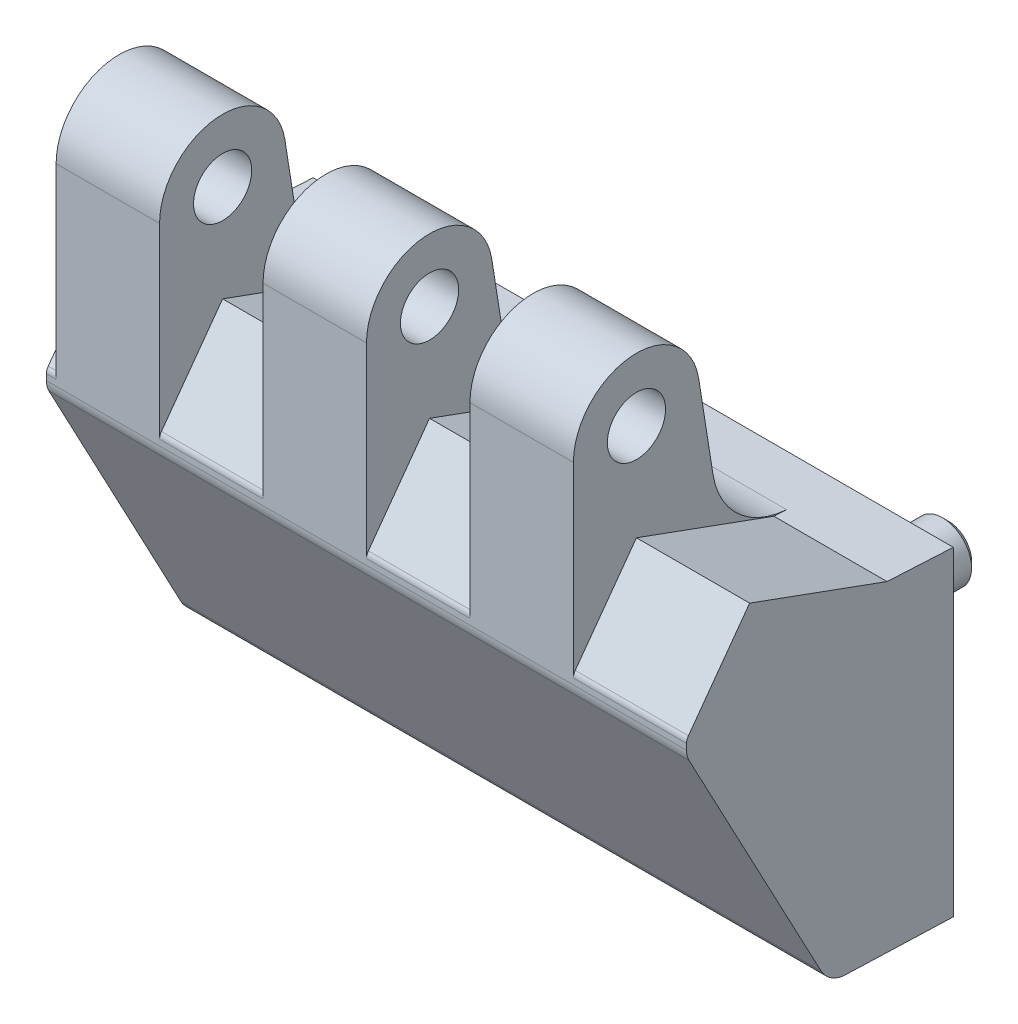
ISO-10303-21;
HEADER;
FILE_DESCRIPTION(('STEP AP214'),'2;1');
FILE_NAME('part.step','',(''),(''),'','','');
FILE_SCHEMA(('AUTOMOTIVE_DESIGN { 1 0 10303 214 1 1 1 1 }'));
ENDSEC;
DATA;
#1=APPLICATION_CONTEXT('core data for automotive mechanical design processes');
#2=APPLICATION_PROTOCOL_DEFINITION('international standard','automotive_design',2000,#1);
#3=PRODUCT_CONTEXT('',#1,'mechanical');
#4=PRODUCT('Part','Part','',(#3));
#5=PRODUCT_RELATED_PRODUCT_CATEGORY('part','',(#4));
#6=PRODUCT_DEFINITION_FORMATION('','',#4);
#7=PRODUCT_DEFINITION_CONTEXT('part definition',#1,'design');
#8=PRODUCT_DEFINITION('design','',#6,#7);
#9=PRODUCT_DEFINITION_SHAPE('','',#8);
#10=(LENGTH_UNIT() NAMED_UNIT(*) SI_UNIT(.MILLI.,.METRE.));
#11=(NAMED_UNIT(*) PLANE_ANGLE_UNIT() SI_UNIT($,.RADIAN.));
#12=(NAMED_UNIT(*) SI_UNIT($,.STERADIAN.) SOLID_ANGLE_UNIT());
#13=UNCERTAINTY_MEASURE_WITH_UNIT(LENGTH_MEASURE(1.E-05),#10,'distance_accuracy_value','');
#14=(GEOMETRIC_REPRESENTATION_CONTEXT(3) GLOBAL_UNCERTAINTY_ASSIGNED_CONTEXT((#13)) GLOBAL_UNIT_ASSIGNED_CONTEXT((#10,
#11,#12)) REPRESENTATION_CONTEXT('',''));
#15=CARTESIAN_POINT('',(0.,0.,0.));
#16=DIRECTION('',(0.,0.,1.));
#17=DIRECTION('',(1.,0.,0.));
#18=AXIS2_PLACEMENT_3D('',#15,#16,#17);
#19=CARTESIAN_POINT('',(49.5,16.3,0.));
#20=DIRECTION('',(0.,0.998629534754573,-0.0523359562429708));
#21=DIRECTION('',(0.,0.0523359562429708,0.998629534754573));
#22=AXIS2_PLACEMENT_3D('',#19,#20,#21);
#23=PLANE('',#22);
#24=DIRECTION('',(1.,0.,0.));
#25=VECTOR('',#24,1.);
#26=CARTESIAN_POINT('',(-15.5,16.5893206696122,5.52056724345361));
#27=LINE('',#26,#25);
#28=CARTESIAN_POINT('',(-4.833333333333,16.5893206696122,5.52056724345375));
#29=VERTEX_POINT('',#28);
#30=CARTESIAN_POINT('',(-15.5,16.5893206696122,5.52056724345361));
#31=VERTEX_POINT('',#30);
#32=EDGE_CURVE('E516',#29,#31,#27,.F.);
#33=ORIENTED_EDGE('',*,*,#32,.F.);
#34=DIRECTION('',(0.,0.0523359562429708,0.998629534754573));
#35=VECTOR('',#34,1.);
#36=CARTESIAN_POINT('',(-4.833333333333,16.3,0.));
#37=LINE('',#36,#35);
#38=CARTESIAN_POINT('',(-4.833333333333,16.658046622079,6.8319365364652));
#39=VERTEX_POINT('',#38);
#40=EDGE_CURVE('E252',#29,#39,#37,.T.);
#41=ORIENTED_EDGE('',*,*,#40,.T.);
#42=DIRECTION('',(-1.,0.,0.));
#43=VECTOR('',#42,1.);
#44=CARTESIAN_POINT('',(49.5,16.658046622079,6.8319365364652));
#45=LINE('',#44,#43);
#46=CARTESIAN_POINT('',(5.833333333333,16.658046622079,6.8319365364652));
#47=VERTEX_POINT('',#46);
#48=EDGE_CURVE('E504',#47,#39,#45,.T.);
#49=ORIENTED_EDGE('',*,*,#48,.F.);
#50=DIRECTION('',(0.,0.0523359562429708,0.998629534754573));
#51=VECTOR('',#50,1.);
#52=CARTESIAN_POINT('',(5.833333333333,16.3,0.));
#53=LINE('',#52,#51);
#54=CARTESIAN_POINT('',(5.833333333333,16.5893206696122,5.52056724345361));
#55=VERTEX_POINT('',#54);
#56=EDGE_CURVE('E409',#55,#47,#53,.T.);
#57=ORIENTED_EDGE('',*,*,#56,.F.);
#58=DIRECTION('',(1.,0.,0.));
#59=VECTOR('',#58,1.);
#60=CARTESIAN_POINT('',(5.833333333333,16.5893206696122,5.52056724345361));
#61=LINE('',#60,#59);
#62=CARTESIAN_POINT('',(16.5,16.5893206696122,5.52056724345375));
#63=VERTEX_POINT('',#62);
#64=EDGE_CURVE('E510',#63,#55,#61,.F.);
#65=ORIENTED_EDGE('',*,*,#64,.F.);
#66=DIRECTION('',(0.,0.0523359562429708,0.998629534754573));
#67=VECTOR('',#66,1.);
#68=CARTESIAN_POINT('',(16.5,16.3,0.));
#69=LINE('',#68,#67);
#70=CARTESIAN_POINT('',(16.5,16.658046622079,6.8319365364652));
#71=VERTEX_POINT('',#70);
#72=EDGE_CURVE('E397',#63,#71,#69,.T.);
#73=ORIENTED_EDGE('',*,*,#72,.T.);
#74=CARTESIAN_POINT('',(27.166666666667,16.658046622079,6.8319365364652));
#75=VERTEX_POINT('',#74);
#76=EDGE_CURVE('E503',#75,#71,#45,.T.);
#77=ORIENTED_EDGE('',*,*,#76,.F.);
#78=DIRECTION('',(0.,0.0523359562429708,0.998629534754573));
#79=VECTOR('',#78,1.);
#80=CARTESIAN_POINT('',(27.166666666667,16.3,0.));
#81=LINE('',#80,#79);
#82=CARTESIAN_POINT('',(27.166666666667,16.5893206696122,5.52056724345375));
#83=VERTEX_POINT('',#82);
#84=EDGE_CURVE('E333',#83,#75,#81,.T.);
#85=ORIENTED_EDGE('',*,*,#84,.F.);
#86=DIRECTION('',(-1.,0.,0.));
#87=VECTOR('',#86,1.);
#88=CARTESIAN_POINT('',(37.833333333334,16.5893206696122,5.52056724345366));
#89=LINE('',#88,#87);
#90=CARTESIAN_POINT('',(37.833333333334,16.5893206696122,5.52056724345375));
#91=VERTEX_POINT('',#90);
#92=EDGE_CURVE('E513',#83,#91,#89,.F.);
#93=ORIENTED_EDGE('',*,*,#92,.T.);
#94=DIRECTION('',(0.,0.0523359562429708,0.998629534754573));
#95=VECTOR('',#94,1.);
#96=CARTESIAN_POINT('',(37.833333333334,16.3,0.));
#97=LINE('',#96,#95);
#98=CARTESIAN_POINT('',(37.833333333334,16.658046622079,6.8319365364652));
#99=VERTEX_POINT('',#98);
#100=EDGE_CURVE('E345',#91,#99,#97,.T.);
#101=ORIENTED_EDGE('',*,*,#100,.T.);
#102=CARTESIAN_POINT('',(49.5,16.658046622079,6.8319365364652));
#103=VERTEX_POINT('',#102);
#104=EDGE_CURVE('E499',#103,#99,#45,.T.);
#105=ORIENTED_EDGE('',*,*,#104,.F.);
#106=DIRECTION('',(0.,0.0523359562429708,0.998629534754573));
#107=VECTOR('',#106,1.);
#108=CARTESIAN_POINT('',(49.5,16.3,0.));
#109=LINE('',#108,#107);
#110=CARTESIAN_POINT('',(49.5,16.3,0.));
#111=VERTEX_POINT('',#110);
#112=EDGE_CURVE('E443',#111,#103,#109,.T.);
#113=ORIENTED_EDGE('',*,*,#112,.F.);
#114=DIRECTION('',(-1.,0.,0.));
#115=VECTOR('',#114,1.);
#116=CARTESIAN_POINT('',(49.5,16.3,0.));
#117=LINE('',#116,#115);
#118=CARTESIAN_POINT('',(-16.5,16.3,0.));
#119=VERTEX_POINT('',#118);
#120=EDGE_CURVE('E502',#111,#119,#117,.T.);
#121=ORIENTED_EDGE('',*,*,#120,.T.);
#122=DIRECTION('',(0.,0.0523359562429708,0.998629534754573));
#123=VECTOR('',#122,1.);
#124=CARTESIAN_POINT('',(-16.5,16.3,0.));
#125=LINE('',#124,#123);
#126=CARTESIAN_POINT('',(-16.5,16.658046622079,6.8319365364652));
#127=VERTEX_POINT('',#126);
#128=EDGE_CURVE('E415',#119,#127,#125,.T.);
#129=ORIENTED_EDGE('',*,*,#128,.T.);
#130=CARTESIAN_POINT('',(-15.5,16.658046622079,6.8319365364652));
#131=VERTEX_POINT('',#130);
#132=EDGE_CURVE('E496',#131,#127,#45,.T.);
#133=ORIENTED_EDGE('',*,*,#132,.F.);
#134=DIRECTION('',(0.,0.0523359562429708,0.998629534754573));
#135=VECTOR('',#134,1.);
#136=CARTESIAN_POINT('',(-15.5,16.3,0.));
#137=LINE('',#136,#135);
#138=EDGE_CURVE('E282',#31,#131,#137,.T.);
#139=ORIENTED_EDGE('',*,*,#138,.F.);
#140=EDGE_LOOP('',(#33,#41,#49,#57,#65,#73,#77,#85,#93,#101,#105,#113,#121,#129,#133,#139));
#141=FACE_BOUND('',#140,.T.);
#142=ADVANCED_FACE('F14',(#141),#23,.T.);
#143=CARTESIAN_POINT('',(49.5,16.658046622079,6.8319365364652));
#144=DIRECTION('',(0.,0.939692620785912,-0.342020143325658));
#145=DIRECTION('',(0.,0.342020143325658,0.939692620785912));
#146=AXIS2_PLACEMENT_3D('',#143,#144,#145);
#147=PLANE('',#146);
#148=ORIENTED_EDGE('',*,*,#132,.T.);
#149=DIRECTION('',(0.,0.342020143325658,0.939692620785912));
#150=VECTOR('',#149,1.);
#151=CARTESIAN_POINT('',(-16.5,16.658046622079,6.8319365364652));
#152=LINE('',#151,#150);
#153=CARTESIAN_POINT('',(-16.5,21.8148,21.));
#154=VERTEX_POINT('',#153);
#155=EDGE_CURVE('E418',#127,#154,#152,.T.);
#156=ORIENTED_EDGE('',*,*,#155,.T.);
#157=DIRECTION('',(-1.,0.,0.));
#158=VECTOR('',#157,1.);
#159=CARTESIAN_POINT('',(49.5,21.8148,21.));
#160=LINE('',#159,#158);
#161=CARTESIAN_POINT('',(-15.5,21.8148,21.));
#162=VERTEX_POINT('',#161);
#163=EDGE_CURVE('E490',#162,#154,#160,.T.);
#164=ORIENTED_EDGE('',*,*,#163,.F.);
#165=DIRECTION('',(0.,0.342020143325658,0.939692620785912));
#166=VECTOR('',#165,1.);
#167=CARTESIAN_POINT('',(-15.5,16.658046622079,6.8319365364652));
#168=LINE('',#167,#166);
#169=EDGE_CURVE('E279',#131,#162,#168,.T.);
#170=ORIENTED_EDGE('',*,*,#169,.F.);
#171=EDGE_LOOP('',(#148,#156,#164,#170));
#172=FACE_BOUND('',#171,.T.);
#173=ADVANCED_FACE('F541',(#172),#147,.T.);
#174=CARTESIAN_POINT('',(49.5,21.8148,21.));
#175=DIRECTION('',(0.,0.587785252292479,0.809016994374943));
#176=DIRECTION('',(0.,-0.809016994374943,0.587785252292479));
#177=AXIS2_PLACEMENT_3D('',#174,#175,#176);
#178=PLANE('',#177);
#179=ORIENTED_EDGE('',*,*,#163,.T.);
#180=DIRECTION('',(0.,-0.809016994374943,0.587785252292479));
#181=VECTOR('',#180,1.);
#182=CARTESIAN_POINT('',(-16.5,21.8148,21.));
#183=LINE('',#182,#181);
#184=CARTESIAN_POINT('',(-16.5,13.131183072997,27.309016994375));
#185=VERTEX_POINT('',#184);
#186=EDGE_CURVE('E421',#154,#185,#183,.T.);
#187=ORIENTED_EDGE('',*,*,#186,.T.);
#188=DIRECTION('',(-1.,0.,0.));
#189=VECTOR('',#188,1.);
#190=CARTESIAN_POINT('',(49.5,13.131183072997,27.309016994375));
#191=LINE('',#190,#189);
#192=CARTESIAN_POINT('',(-15.5,13.131183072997,27.309016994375));
#193=VERTEX_POINT('',#192);
#194=EDGE_CURVE('E484',#193,#185,#191,.T.);
#195=ORIENTED_EDGE('',*,*,#194,.F.);
#196=DIRECTION('',(0.,-0.809016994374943,0.587785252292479));
#197=VECTOR('',#196,1.);
#198=CARTESIAN_POINT('',(-15.5,21.8148,21.));
#199=LINE('',#198,#197);
#200=EDGE_CURVE('E276',#162,#193,#199,.T.);
#201=ORIENTED_EDGE('',*,*,#200,.F.);
#202=EDGE_LOOP('',(#179,#187,#195,#201));
#203=FACE_BOUND('',#202,.T.);
#204=ADVANCED_FACE('F548',(#203),#178,.T.);
#205=CARTESIAN_POINT('',(49.5,12.5433978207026,26.4999999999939));
#206=DIRECTION('',(-1.,0.,0.));
#207=DIRECTION('',(0.,1.,0.));
#208=AXIS2_PLACEMENT_3D('',#205,#206,#207);
#209=CYLINDRICAL_SURFACE('',#208,1.00000000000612);
#210=ORIENTED_EDGE('',*,*,#194,.T.);
#211=CARTESIAN_POINT('',(-16.5,12.5433978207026,26.4999999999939));
#212=DIRECTION('',(1.,0.,0.));
#213=DIRECTION('',(0.,1.,0.));
#214=AXIS2_PLACEMENT_3D('',#211,#212,#213);
#215=CIRCLE('',#214,1.00000000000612);
#216=CARTESIAN_POINT('',(-16.5,12.543397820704,27.5));
#217=VERTEX_POINT('',#216);
#218=EDGE_CURVE('E424',#185,#217,#215,.T.);
#219=ORIENTED_EDGE('',*,*,#218,.T.);
#220=DIRECTION('',(-1.,0.,0.));
#221=VECTOR('',#220,1.);
#222=CARTESIAN_POINT('',(49.5,12.543397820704,27.5));
#223=LINE('',#222,#221);
#224=CARTESIAN_POINT('',(-15.5,12.543397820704,27.5));
#225=VERTEX_POINT('',#224);
#226=EDGE_CURVE('E480',#225,#217,#223,.T.);
#227=ORIENTED_EDGE('',*,*,#226,.F.);
#228=CARTESIAN_POINT('',(-15.5,12.5433978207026,26.4999999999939));
#229=DIRECTION('',(-1.,0.,0.));
#230=DIRECTION('',(0.,-1.,0.));
#231=AXIS2_PLACEMENT_3D('',#228,#229,#230);
#232=CIRCLE('',#231,1.00000000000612);
#233=EDGE_CURVE('E273',#193,#225,#232,.F.);
#234=ORIENTED_EDGE('',*,*,#233,.F.);
#235=EDGE_LOOP('',(#210,#219,#227,#234));
#236=FACE_BOUND('',#235,.T.);
#237=ADVANCED_FACE('F671',(#236),#209,.T.);
#238=ORIENTED_EDGE('',*,*,#76,.T.);
#239=DIRECTION('',(0.,0.342020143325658,0.939692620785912));
#240=VECTOR('',#239,1.);
#241=CARTESIAN_POINT('',(16.5,16.658046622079,6.8319365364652));
#242=LINE('',#241,#240);
#243=CARTESIAN_POINT('',(16.5,21.8148,21.));
#244=VERTEX_POINT('',#243);
#245=EDGE_CURVE('E394',#71,#244,#242,.T.);
#246=ORIENTED_EDGE('',*,*,#245,.T.);
#247=CARTESIAN_POINT('',(27.166666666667,21.8148,21.));
#248=VERTEX_POINT('',#247);
#249=EDGE_CURVE('E497',#248,#244,#160,.T.);
#250=ORIENTED_EDGE('',*,*,#249,.F.);
#251=DIRECTION('',(0.,0.342020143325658,0.939692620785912));
#252=VECTOR('',#251,1.);
#253=CARTESIAN_POINT('',(27.166666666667,16.658046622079,6.8319365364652));
#254=LINE('',#253,#252);
#255=EDGE_CURVE('E330',#75,#248,#254,.T.);
#256=ORIENTED_EDGE('',*,*,#255,.F.);
#257=EDGE_LOOP('',(#238,#246,#250,#256));
#258=FACE_BOUND('',#257,.T.);
#259=ADVANCED_FACE('F551',(#258),#147,.T.);
#260=ORIENTED_EDGE('',*,*,#249,.T.);
#261=DIRECTION('',(0.,-0.809016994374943,0.587785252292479));
#262=VECTOR('',#261,1.);
#263=CARTESIAN_POINT('',(16.5,21.8148,21.));
#264=LINE('',#263,#262);
#265=CARTESIAN_POINT('',(16.5,13.131183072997,27.309016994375));
#266=VERTEX_POINT('',#265);
#267=EDGE_CURVE('E391',#244,#266,#264,.T.);
#268=ORIENTED_EDGE('',*,*,#267,.T.);
#269=CARTESIAN_POINT('',(27.166666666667,13.131183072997,27.309016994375));
#270=VERTEX_POINT('',#269);
#271=EDGE_CURVE('E491',#270,#266,#191,.T.);
#272=ORIENTED_EDGE('',*,*,#271,.F.);
#273=DIRECTION('',(0.,-0.809016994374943,0.587785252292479));
#274=VECTOR('',#273,1.);
#275=CARTESIAN_POINT('',(27.166666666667,21.8148,21.));
#276=LINE('',#275,#274);
#277=EDGE_CURVE('E327',#248,#270,#276,.T.);
#278=ORIENTED_EDGE('',*,*,#277,.F.);
#279=EDGE_LOOP('',(#260,#268,#272,#278));
#280=FACE_BOUND('',#279,.T.);
#281=ADVANCED_FACE('F653',(#280),#178,.T.);
#282=ORIENTED_EDGE('',*,*,#271,.T.);
#283=CARTESIAN_POINT('',(16.5,12.5433978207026,26.4999999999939));
#284=DIRECTION('',(-1.,0.,0.));
#285=DIRECTION('',(0.,-1.,0.));
#286=AXIS2_PLACEMENT_3D('',#283,#284,#285);
#287=CIRCLE('',#286,1.00000000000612);
#288=CARTESIAN_POINT('',(16.5,12.543397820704,27.5));
#289=VERTEX_POINT('',#288);
#290=EDGE_CURVE('E388',#266,#289,#287,.F.);
#291=ORIENTED_EDGE('',*,*,#290,.T.);
#292=CARTESIAN_POINT('',(27.166666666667,12.543397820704,27.5));
#293=VERTEX_POINT('',#292);
#294=EDGE_CURVE('E485',#293,#289,#223,.T.);
#295=ORIENTED_EDGE('',*,*,#294,.F.);
#296=CARTESIAN_POINT('',(27.166666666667,12.5433978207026,26.4999999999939));
#297=DIRECTION('',(-1.,0.,0.));
#298=DIRECTION('',(0.,-1.,0.));
#299=AXIS2_PLACEMENT_3D('',#296,#297,#298);
#300=CIRCLE('',#299,1.00000000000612);
#301=EDGE_CURVE('E324',#270,#293,#300,.F.);
#302=ORIENTED_EDGE('',*,*,#301,.F.);
#303=EDGE_LOOP('',(#282,#291,#295,#302));
#304=FACE_BOUND('',#303,.T.);
#305=ADVANCED_FACE('F668',(#304),#209,.T.);
#306=DIRECTION('',(0.,0.342020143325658,0.939692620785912));
#307=VECTOR('',#306,1.);
#308=CARTESIAN_POINT('',(-4.833333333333,16.658046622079,6.8319365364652));
#309=LINE('',#308,#307);
#310=CARTESIAN_POINT('',(-4.833333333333,21.8148,21.));
#311=VERTEX_POINT('',#310);
#312=EDGE_CURVE('E269',#39,#311,#309,.T.);
#313=ORIENTED_EDGE('',*,*,#312,.T.);
#314=CARTESIAN_POINT('',(5.833333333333,21.8148,21.));
#315=VERTEX_POINT('',#314);
#316=EDGE_CURVE('E498',#315,#311,#160,.T.);
#317=ORIENTED_EDGE('',*,*,#316,.F.);
#318=DIRECTION('',(0.,0.342020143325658,0.939692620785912));
#319=VECTOR('',#318,1.);
#320=CARTESIAN_POINT('',(5.833333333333,16.658046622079,6.8319365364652));
#321=LINE('',#320,#319);
#322=EDGE_CURVE('E406',#47,#315,#321,.T.);
#323=ORIENTED_EDGE('',*,*,#322,.F.);
#324=ORIENTED_EDGE('',*,*,#48,.T.);
#325=EDGE_LOOP('',(#313,#317,#323,#324));
#326=FACE_BOUND('',#325,.T.);
#327=ADVANCED_FACE('F563',(#326),#147,.T.);
#328=DIRECTION('',(0.,-0.809016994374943,0.587785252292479));
#329=VECTOR('',#328,1.);
#330=CARTESIAN_POINT('',(-4.833333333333,21.8148,21.));
#331=LINE('',#330,#329);
#332=CARTESIAN_POINT('',(-4.833333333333,13.131183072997,27.309016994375));
#333=VERTEX_POINT('',#332);
#334=EDGE_CURVE('E261',#311,#333,#331,.T.);
#335=ORIENTED_EDGE('',*,*,#334,.T.);
#336=CARTESIAN_POINT('',(5.833333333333,13.131183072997,27.309016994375));
#337=VERTEX_POINT('',#336);
#338=EDGE_CURVE('E492',#337,#333,#191,.T.);
#339=ORIENTED_EDGE('',*,*,#338,.F.);
#340=DIRECTION('',(0.,-0.809016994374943,0.587785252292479));
#341=VECTOR('',#340,1.);
#342=CARTESIAN_POINT('',(5.833333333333,21.8148,21.));
#343=LINE('',#342,#341);
#344=EDGE_CURVE('E403',#315,#337,#343,.T.);
#345=ORIENTED_EDGE('',*,*,#344,.F.);
#346=ORIENTED_EDGE('',*,*,#316,.T.);
#347=EDGE_LOOP('',(#335,#339,#345,#346));
#348=FACE_BOUND('',#347,.T.);
#349=ADVANCED_FACE('F637',(#348),#178,.T.);
#350=CARTESIAN_POINT('',(-4.833333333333,12.5433978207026,26.4999999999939));
#351=DIRECTION('',(-1.,0.,0.));
#352=DIRECTION('',(0.,-1.,0.));
#353=AXIS2_PLACEMENT_3D('',#350,#351,#352);
#354=CIRCLE('',#353,1.00000000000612);
#355=CARTESIAN_POINT('',(-4.833333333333,12.543397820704,27.5));
#356=VERTEX_POINT('',#355);
#357=EDGE_CURVE('E258',#333,#356,#354,.F.);
#358=ORIENTED_EDGE('',*,*,#357,.T.);
#359=CARTESIAN_POINT('',(5.833333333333,12.543397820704,27.5));
#360=VERTEX_POINT('',#359);
#361=EDGE_CURVE('E486',#360,#356,#223,.T.);
#362=ORIENTED_EDGE('',*,*,#361,.F.);
#363=CARTESIAN_POINT('',(5.833333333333,12.5433978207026,26.4999999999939));
#364=DIRECTION('',(-1.,0.,0.));
#365=DIRECTION('',(0.,-1.,0.));
#366=AXIS2_PLACEMENT_3D('',#363,#364,#365);
#367=CIRCLE('',#366,1.00000000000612);
#368=EDGE_CURVE('E400',#337,#360,#367,.F.);
#369=ORIENTED_EDGE('',*,*,#368,.F.);
#370=ORIENTED_EDGE('',*,*,#338,.T.);
#371=EDGE_LOOP('',(#358,#362,#369,#370));
#372=FACE_BOUND('',#371,.T.);
#373=ADVANCED_FACE('F564',(#372),#209,.T.);
#374=CARTESIAN_POINT('',(49.5,-16.312982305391,11.082736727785));
#375=DIRECTION('',(0.,-0.999390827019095,0.0348994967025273));
#376=DIRECTION('',(0.,-0.0348994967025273,-0.999390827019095));
#377=AXIS2_PLACEMENT_3D('',#374,#375,#376);
#378=PLANE('',#377);
#379=DIRECTION('',(-1.,0.,0.));
#380=VECTOR('',#379,1.);
#381=CARTESIAN_POINT('',(49.5,-16.7,0.));
#382=LINE('',#381,#380);
#383=CARTESIAN_POINT('',(49.5,-16.7,0.));
#384=VERTEX_POINT('',#383);
#385=CARTESIAN_POINT('',(-16.5,-16.7,0.));
#386=VERTEX_POINT('',#385);
#387=EDGE_CURVE('E507',#384,#386,#382,.T.);
#388=ORIENTED_EDGE('',*,*,#387,.F.);
#389=DIRECTION('',(0.,-0.0348994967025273,-0.999390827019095));
#390=VECTOR('',#389,1.);
#391=CARTESIAN_POINT('',(49.5,-16.312982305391,11.082736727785));
#392=LINE('',#391,#390);
#393=CARTESIAN_POINT('',(49.5,-16.312982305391,11.082736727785));
#394=VERTEX_POINT('',#393);
#395=EDGE_CURVE('E438',#394,#384,#392,.T.);
#396=ORIENTED_EDGE('',*,*,#395,.F.);
#397=DIRECTION('',(-1.,0.,0.));
#398=VECTOR('',#397,1.);
#399=CARTESIAN_POINT('',(49.5,-16.312982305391,11.082736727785));
#400=LINE('',#399,#398);
#401=CARTESIAN_POINT('',(-16.5,-16.312982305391,11.082736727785));
#402=VERTEX_POINT('',#401);
#403=EDGE_CURVE('E466',#394,#402,#400,.T.);
#404=ORIENTED_EDGE('',*,*,#403,.T.);
#405=DIRECTION('',(0.,-0.0348994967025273,-0.999390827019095));
#406=VECTOR('',#405,1.);
#407=CARTESIAN_POINT('',(-16.5,-16.312982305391,11.082736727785));
#408=LINE('',#407,#406);
#409=EDGE_CURVE('E412',#402,#386,#408,.T.);
#410=ORIENTED_EDGE('',*,*,#409,.T.);
#411=EDGE_LOOP('',(#388,#396,#404,#410));
#412=FACE_BOUND('',#411,.T.);
#413=ADVANCED_FACE('F16',(#412),#378,.T.);
#414=CARTESIAN_POINT('',(49.5,-16.7,0.));
#415=DIRECTION('',(0.,0.,-1.));
#416=DIRECTION('',(1.,0.,0.));
#417=AXIS2_PLACEMENT_3D('',#414,#415,#416);
#418=PLANE('',#417);
#419=CARTESIAN_POINT('',(33.,0.,0.));
#420=DIRECTION('',(0.,0.,1.));
#421=DIRECTION('',(1.,0.,0.));
#422=AXIS2_PLACEMENT_3D('',#419,#420,#421);
#423=CIRCLE('',#422,3.);
#424=CARTESIAN_POINT('',(36.,0.,0.));
#425=VERTEX_POINT('',#424);
#426=EDGE_CURVE('E9',#425,#425,#423,.T.);
#427=ORIENTED_EDGE('',*,*,#426,.T.);
#428=EDGE_LOOP('',(#427));
#429=FACE_BOUND('',#428,.T.);
#430=CARTESIAN_POINT('',(0.,0.,0.));
#431=DIRECTION('',(0.,0.,1.));
#432=DIRECTION('',(1.,0.,0.));
#433=AXIS2_PLACEMENT_3D('',#430,#431,#432);
#434=CIRCLE('',#433,3.);
#435=CARTESIAN_POINT('',(3.,0.,0.));
#436=VERTEX_POINT('',#435);
#437=EDGE_CURVE('E22',#436,#436,#434,.T.);
#438=ORIENTED_EDGE('',*,*,#437,.T.);
#439=EDGE_LOOP('',(#438));
#440=FACE_BOUND('',#439,.T.);
#441=ORIENTED_EDGE('',*,*,#120,.F.);
#442=DIRECTION('',(0.,1.,0.));
#443=VECTOR('',#442,1.);
#444=CARTESIAN_POINT('',(49.5,-16.7,0.));
#445=LINE('',#444,#443);
#446=EDGE_CURVE('E441',#384,#111,#445,.T.);
#447=ORIENTED_EDGE('',*,*,#446,.F.);
#448=ORIENTED_EDGE('',*,*,#387,.T.);
#449=DIRECTION('',(0.,1.,0.));
#450=VECTOR('',#449,1.);
#451=CARTESIAN_POINT('',(-16.5,-16.7,0.));
#452=LINE('',#451,#450);
#453=EDGE_CURVE('E413',#386,#119,#452,.T.);
#454=ORIENTED_EDGE('',*,*,#453,.T.);
#455=EDGE_LOOP('',(#441,#447,#448,#454));
#456=FACE_BOUND('',#455,.T.);
#457=ADVANCED_FACE('F520',(#429,#440,#456),#418,.T.);
#458=DIRECTION('',(0.,0.342020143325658,0.939692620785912));
#459=VECTOR('',#458,1.);
#460=CARTESIAN_POINT('',(37.833333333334,16.658046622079,6.8319365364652));
#461=LINE('',#460,#459);
#462=CARTESIAN_POINT('',(37.833333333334,21.8148,21.));
#463=VERTEX_POINT('',#462);
#464=EDGE_CURVE('E342',#99,#463,#461,.T.);
#465=ORIENTED_EDGE('',*,*,#464,.T.);
#466=CARTESIAN_POINT('',(49.5,21.8148,21.));
#467=VERTEX_POINT('',#466);
#468=EDGE_CURVE('E493',#467,#463,#160,.T.);
#469=ORIENTED_EDGE('',*,*,#468,.F.);
#470=DIRECTION('',(0.,0.342020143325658,0.939692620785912));
#471=VECTOR('',#470,1.);
#472=CARTESIAN_POINT('',(49.5,16.658046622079,6.8319365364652));
#473=LINE('',#472,#471);
#474=EDGE_CURVE('E446',#103,#467,#473,.T.);
#475=ORIENTED_EDGE('',*,*,#474,.F.);
#476=ORIENTED_EDGE('',*,*,#104,.T.);
#477=EDGE_LOOP('',(#465,#469,#475,#476));
#478=FACE_BOUND('',#477,.T.);
#479=ADVANCED_FACE('F552',(#478),#147,.T.);
#480=DIRECTION('',(0.,-0.809016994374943,0.587785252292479));
#481=VECTOR('',#480,1.);
#482=CARTESIAN_POINT('',(37.833333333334,21.8148,21.));
#483=LINE('',#482,#481);
#484=CARTESIAN_POINT('',(37.833333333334,13.131183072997,27.309016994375));
#485=VERTEX_POINT('',#484);
#486=EDGE_CURVE('E339',#463,#485,#483,.T.);
#487=ORIENTED_EDGE('',*,*,#486,.T.);
#488=CARTESIAN_POINT('',(49.5,13.131183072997,27.309016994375));
#489=VERTEX_POINT('',#488);
#490=EDGE_CURVE('E487',#489,#485,#191,.T.);
#491=ORIENTED_EDGE('',*,*,#490,.F.);
#492=DIRECTION('',(0.,-0.809016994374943,0.587785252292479));
#493=VECTOR('',#492,1.);
#494=CARTESIAN_POINT('',(49.5,21.8148,21.));
#495=LINE('',#494,#493);
#496=EDGE_CURVE('E449',#467,#489,#495,.T.);
#497=ORIENTED_EDGE('',*,*,#496,.F.);
#498=ORIENTED_EDGE('',*,*,#468,.T.);
#499=EDGE_LOOP('',(#487,#491,#497,#498));
#500=FACE_BOUND('',#499,.T.);
#501=ADVANCED_FACE('F561',(#500),#178,.T.);
#502=CARTESIAN_POINT('',(37.833333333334,12.5433978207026,26.4999999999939));
#503=DIRECTION('',(-1.,0.,0.));
#504=DIRECTION('',(0.,-1.,0.));
#505=AXIS2_PLACEMENT_3D('',#502,#503,#504);
#506=CIRCLE('',#505,1.00000000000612);
#507=CARTESIAN_POINT('',(37.833333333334,12.543397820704,27.5));
#508=VERTEX_POINT('',#507);
#509=EDGE_CURVE('E336',#485,#508,#506,.F.);
#510=ORIENTED_EDGE('',*,*,#509,.T.);
#511=CARTESIAN_POINT('',(49.5,12.543397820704,27.5));
#512=VERTEX_POINT('',#511);
#513=EDGE_CURVE('E481',#512,#508,#223,.T.);
#514=ORIENTED_EDGE('',*,*,#513,.F.);
#515=CARTESIAN_POINT('',(49.5,12.5433978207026,26.4999999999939));
#516=DIRECTION('',(1.,0.,0.));
#517=DIRECTION('',(0.,1.,0.));
#518=AXIS2_PLACEMENT_3D('',#515,#516,#517);
#519=CIRCLE('',#518,1.00000000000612);
#520=EDGE_CURVE('E452',#489,#512,#519,.T.);
#521=ORIENTED_EDGE('',*,*,#520,.F.);
#522=ORIENTED_EDGE('',*,*,#490,.T.);
#523=EDGE_LOOP('',(#510,#514,#521,#522));
#524=FACE_BOUND('',#523,.T.);
#525=ADVANCED_FACE('F705',(#524),#209,.T.);
#526=CARTESIAN_POINT('',(49.5,12.543397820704,27.5));
#527=DIRECTION('',(0.,0.,1.));
#528=DIRECTION('',(-1.,0.,0.));
#529=AXIS2_PLACEMENT_3D('',#526,#527,#528);
#530=PLANE('',#529);
#531=ORIENTED_EDGE('',*,*,#226,.T.);
#532=DIRECTION('',(0.,-1.,0.));
#533=VECTOR('',#532,1.);
#534=CARTESIAN_POINT('',(-16.5,12.543397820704,27.5));
#535=LINE('',#534,#533);
#536=CARTESIAN_POINT('',(-16.5,11.929305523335,27.5));
#537=VERTEX_POINT('',#536);
#538=EDGE_CURVE('E427',#217,#537,#535,.T.);
#539=ORIENTED_EDGE('',*,*,#538,.T.);
#540=DIRECTION('',(-1.,0.,0.));
#541=VECTOR('',#540,1.);
#542=CARTESIAN_POINT('',(49.5,11.929305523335,27.5));
#543=LINE('',#542,#541);
#544=CARTESIAN_POINT('',(49.5,11.929305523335,27.5));
#545=VERTEX_POINT('',#544);
#546=EDGE_CURVE('E477',#545,#537,#543,.T.);
#547=ORIENTED_EDGE('',*,*,#546,.F.);
#548=DIRECTION('',(0.,-1.,0.));
#549=VECTOR('',#548,1.);
#550=CARTESIAN_POINT('',(49.5,12.543397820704,27.5));
#551=LINE('',#550,#549);
#552=EDGE_CURVE('E455',#512,#545,#551,.T.);
#553=ORIENTED_EDGE('',*,*,#552,.F.);
#554=ORIENTED_EDGE('',*,*,#513,.T.);
#555=DIRECTION('',(0.,-1.,0.));
#556=VECTOR('',#555,1.);
#557=CARTESIAN_POINT('',(37.833333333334,31.8,27.5));
#558=LINE('',#557,#556);
#559=CARTESIAN_POINT('',(37.833333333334,31.8,27.5));
#560=VERTEX_POINT('',#559);
#561=EDGE_CURVE('E302',#560,#508,#558,.T.);
#562=ORIENTED_EDGE('',*,*,#561,.F.);
#563=DIRECTION('',(-1.,0.,0.));
#564=VECTOR('',#563,1.);
#565=CARTESIAN_POINT('',(37.833333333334,31.8,27.5));
#566=LINE('',#565,#564);
#567=CARTESIAN_POINT('',(27.166666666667,31.8,27.5));
#568=VERTEX_POINT('',#567);
#569=EDGE_CURVE('E315',#560,#568,#566,.T.);
#570=ORIENTED_EDGE('',*,*,#569,.T.);
#571=DIRECTION('',(0.,-1.,0.));
#572=VECTOR('',#571,1.);
#573=CARTESIAN_POINT('',(27.166666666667,31.8,27.5));
#574=LINE('',#573,#572);
#575=EDGE_CURVE('E284',#568,#293,#574,.T.);
#576=ORIENTED_EDGE('',*,*,#575,.T.);
#577=ORIENTED_EDGE('',*,*,#294,.T.);
#578=DIRECTION('',(0.,-1.,0.));
#579=VECTOR('',#578,1.);
#580=CARTESIAN_POINT('',(16.5,31.8,27.5));
#581=LINE('',#580,#579);
#582=CARTESIAN_POINT('',(16.5,31.8,27.5));
#583=VERTEX_POINT('',#582);
#584=EDGE_CURVE('E348',#583,#289,#581,.T.);
#585=ORIENTED_EDGE('',*,*,#584,.F.);
#586=DIRECTION('',(1.,0.,0.));
#587=VECTOR('',#586,1.);
#588=CARTESIAN_POINT('',(5.833333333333,31.8,27.5));
#589=LINE('',#588,#587);
#590=CARTESIAN_POINT('',(5.833333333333,31.8,27.5));
#591=VERTEX_POINT('',#590);
#592=EDGE_CURVE('E379',#591,#583,#589,.T.);
#593=ORIENTED_EDGE('',*,*,#592,.F.);
#594=DIRECTION('',(0.,-1.,0.));
#595=VECTOR('',#594,1.);
#596=CARTESIAN_POINT('',(5.833333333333,31.8,27.5));
#597=LINE('',#596,#595);
#598=EDGE_CURVE('E366',#591,#360,#597,.T.);
#599=ORIENTED_EDGE('',*,*,#598,.T.);
#600=ORIENTED_EDGE('',*,*,#361,.T.);
#601=DIRECTION('',(0.,-1.,0.));
#602=VECTOR('',#601,1.);
#603=CARTESIAN_POINT('',(-4.833333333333,31.8,27.5));
#604=LINE('',#603,#602);
#605=CARTESIAN_POINT('',(-4.833333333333,31.8,27.5));
#606=VERTEX_POINT('',#605);
#607=EDGE_CURVE('E255',#606,#356,#604,.T.);
#608=ORIENTED_EDGE('',*,*,#607,.F.);
#609=DIRECTION('',(1.,0.,0.));
#610=VECTOR('',#609,1.);
#611=CARTESIAN_POINT('',(-15.5,31.8,27.5));
#612=LINE('',#611,#610);
#613=CARTESIAN_POINT('',(-15.5,31.8,27.5));
#614=VERTEX_POINT('',#613);
#615=EDGE_CURVE('E263',#614,#606,#612,.T.);
#616=ORIENTED_EDGE('',*,*,#615,.F.);
#617=DIRECTION('',(0.,-1.,0.));
#618=VECTOR('',#617,1.);
#619=CARTESIAN_POINT('',(-15.5,31.8,27.5));
#620=LINE('',#619,#618);
#621=EDGE_CURVE('E612',#614,#225,#620,.T.);
#622=ORIENTED_EDGE('',*,*,#621,.T.);
#623=EDGE_LOOP('',(#531,#539,#547,#553,#554,#562,#570,#576,#577,#585,#593,#599,#600,#608,#616,#622));
#624=FACE_BOUND('',#623,.T.);
#625=ADVANCED_FACE('F630',(#624),#530,.T.);
#626=CARTESIAN_POINT('',(49.5,11.9293055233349,25.2499999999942));
#627=DIRECTION('',(-1.,0.,0.));
#628=DIRECTION('',(0.,1.,0.));
#629=AXIS2_PLACEMENT_3D('',#626,#627,#628);
#630=CYLINDRICAL_SURFACE('',#629,2.25000000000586);
#631=DIRECTION('',(-1.,0.,0.));
#632=VECTOR('',#631,1.);
#633=CARTESIAN_POINT('',(49.5,10.872994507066,27.236632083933));
#634=LINE('',#633,#632);
#635=CARTESIAN_POINT('',(49.5,10.872994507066,27.236632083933));
#636=VERTEX_POINT('',#635);
#637=CARTESIAN_POINT('',(-16.5,10.872994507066,27.236632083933));
#638=VERTEX_POINT('',#637);
#639=EDGE_CURVE('E474',#636,#638,#634,.T.);
#640=ORIENTED_EDGE('',*,*,#639,.F.);
#641=CARTESIAN_POINT('',(49.5,11.9293055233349,25.2499999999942));
#642=DIRECTION('',(1.,0.,0.));
#643=DIRECTION('',(0.,1.,0.));
#644=AXIS2_PLACEMENT_3D('',#641,#642,#643);
#645=CIRCLE('',#644,2.25000000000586);
#646=EDGE_CURVE('E458',#545,#636,#645,.T.);
#647=ORIENTED_EDGE('',*,*,#646,.F.);
#648=ORIENTED_EDGE('',*,*,#546,.T.);
#649=CARTESIAN_POINT('',(-16.5,11.9293055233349,25.2499999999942));
#650=DIRECTION('',(1.,0.,0.));
#651=DIRECTION('',(0.,1.,0.));
#652=AXIS2_PLACEMENT_3D('',#649,#650,#651);
#653=CIRCLE('',#652,2.25000000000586);
#654=EDGE_CURVE('E430',#537,#638,#653,.T.);
#655=ORIENTED_EDGE('',*,*,#654,.T.);
#656=EDGE_LOOP('',(#640,#647,#648,#655));
#657=FACE_BOUND('',#656,.T.);
#658=ADVANCED_FACE('F701',(#657),#630,.T.);
#659=CARTESIAN_POINT('',(49.5,10.872994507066,27.236632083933));
#660=DIRECTION('',(0.,-0.469471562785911,0.882947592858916));
#661=DIRECTION('',(0.,-0.882947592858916,-0.469471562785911));
#662=AXIS2_PLACEMENT_3D('',#659,#660,#661);
#663=PLANE('',#662);
#664=DIRECTION('',(-1.,0.,0.));
#665=VECTOR('',#664,1.);
#666=CARTESIAN_POINT('',(49.5,-14.723224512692,13.626881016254));
#667=LINE('',#666,#665);
#668=CARTESIAN_POINT('',(49.5,-14.723224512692,13.626881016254));
#669=VERTEX_POINT('',#668);
#670=CARTESIAN_POINT('',(-16.5,-14.723224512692,13.626881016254));
#671=VERTEX_POINT('',#670);
#672=EDGE_CURVE('E471',#669,#671,#667,.T.);
#673=ORIENTED_EDGE('',*,*,#672,.F.);
#674=DIRECTION('',(0.,-0.882947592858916,-0.469471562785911));
#675=VECTOR('',#674,1.);
#676=CARTESIAN_POINT('',(49.5,10.872994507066,27.236632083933));
#677=LINE('',#676,#675);
#678=EDGE_CURVE('E461',#636,#669,#677,.T.);
#679=ORIENTED_EDGE('',*,*,#678,.F.);
#680=ORIENTED_EDGE('',*,*,#639,.T.);
#681=DIRECTION('',(0.,-0.882947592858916,-0.469471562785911));
#682=VECTOR('',#681,1.);
#683=CARTESIAN_POINT('',(-16.5,10.872994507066,27.236632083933));
#684=LINE('',#683,#682);
#685=EDGE_CURVE('E433',#638,#671,#684,.T.);
#686=ORIENTED_EDGE('',*,*,#685,.T.);
#687=EDGE_LOOP('',(#673,#679,#680,#686));
#688=FACE_BOUND('',#687,.T.);
#689=ADVANCED_FACE('F698',(#688),#663,.T.);
#690=CARTESIAN_POINT('',(49.5,-13.3148098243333,10.9780382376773));
#691=DIRECTION('',(-1.,0.,0.));
#692=DIRECTION('',(0.,1.,0.));
#693=AXIS2_PLACEMENT_3D('',#690,#691,#692);
#694=CYLINDRICAL_SURFACE('',#693,3.00000000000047);
#695=ORIENTED_EDGE('',*,*,#403,.F.);
#696=CARTESIAN_POINT('',(49.5,-13.3148098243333,10.9780382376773));
#697=DIRECTION('',(1.,0.,0.));
#698=DIRECTION('',(0.,1.,0.));
#699=AXIS2_PLACEMENT_3D('',#696,#697,#698);
#700=CIRCLE('',#699,3.00000000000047);
#701=EDGE_CURVE('E464',#669,#394,#700,.T.);
#702=ORIENTED_EDGE('',*,*,#701,.F.);
#703=ORIENTED_EDGE('',*,*,#672,.T.);
#704=CARTESIAN_POINT('',(-16.5,-13.3148098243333,10.9780382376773));
#705=DIRECTION('',(1.,0.,0.));
#706=DIRECTION('',(0.,1.,0.));
#707=AXIS2_PLACEMENT_3D('',#704,#705,#706);
#708=CIRCLE('',#707,3.00000000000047);
#709=EDGE_CURVE('E436',#671,#402,#708,.T.);
#710=ORIENTED_EDGE('',*,*,#709,.T.);
#711=EDGE_LOOP('',(#695,#702,#703,#710));
#712=FACE_BOUND('',#711,.T.);
#713=ADVANCED_FACE('F696',(#712),#694,.T.);
#714=CARTESIAN_POINT('',(49.5,12.5433978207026,26.4999999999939));
#715=DIRECTION('',(-1.,0.,0.));
#716=DIRECTION('',(0.,1.,0.));
#717=AXIS2_PLACEMENT_3D('',#714,#715,#716);
#718=PLANE('',#717);
#719=ORIENTED_EDGE('',*,*,#395,.T.);
#720=ORIENTED_EDGE('',*,*,#446,.T.);
#721=ORIENTED_EDGE('',*,*,#112,.T.);
#722=ORIENTED_EDGE('',*,*,#474,.T.);
#723=ORIENTED_EDGE('',*,*,#496,.T.);
#724=ORIENTED_EDGE('',*,*,#520,.T.);
#725=ORIENTED_EDGE('',*,*,#552,.T.);
#726=ORIENTED_EDGE('',*,*,#646,.T.);
#727=ORIENTED_EDGE('',*,*,#678,.T.);
#728=ORIENTED_EDGE('',*,*,#701,.T.);
#729=EDGE_LOOP('',(#719,#720,#721,#722,#723,#724,#725,#726,#727,#728));
#730=FACE_BOUND('',#729,.T.);
#731=ADVANCED_FACE('F693',(#730),#718,.F.);
#732=CARTESIAN_POINT('',(-16.5,12.5433978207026,26.4999999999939));
#733=DIRECTION('',(-1.,0.,0.));
#734=DIRECTION('',(0.,1.,0.));
#735=AXIS2_PLACEMENT_3D('',#732,#733,#734);
#736=PLANE('',#735);
#737=ORIENTED_EDGE('',*,*,#409,.F.);
#738=ORIENTED_EDGE('',*,*,#709,.F.);
#739=ORIENTED_EDGE('',*,*,#685,.F.);
#740=ORIENTED_EDGE('',*,*,#654,.F.);
#741=ORIENTED_EDGE('',*,*,#538,.F.);
#742=ORIENTED_EDGE('',*,*,#218,.F.);
#743=ORIENTED_EDGE('',*,*,#186,.F.);
#744=ORIENTED_EDGE('',*,*,#155,.F.);
#745=ORIENTED_EDGE('',*,*,#128,.F.);
#746=ORIENTED_EDGE('',*,*,#453,.F.);
#747=EDGE_LOOP('',(#737,#738,#739,#740,#741,#742,#743,#744,#745,#746));
#748=FACE_BOUND('',#747,.T.);
#749=ADVANCED_FACE('F675',(#748),#736,.T.);
#750=CARTESIAN_POINT('',(5.833333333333,24.820299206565,4.96066339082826));
#751=DIRECTION('',(1.,0.,0.));
#752=DIRECTION('',(0.,-1.,0.));
#753=AXIS2_PLACEMENT_3D('',#750,#751,#752);
#754=CYLINDRICAL_SURFACE('',#753,8.2499999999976);
#755=ORIENTED_EDGE('',*,*,#64,.T.);
#756=CARTESIAN_POINT('',(5.833333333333,24.820299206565,4.96066339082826));
#757=DIRECTION('',(-1.,0.,0.));
#758=DIRECTION('',(0.,1.,0.));
#759=AXIS2_PLACEMENT_3D('',#756,#757,#758);
#760=CIRCLE('',#759,8.2499999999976);
#761=CARTESIAN_POINT('',(5.833333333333,23.5297148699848,13.109092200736));
#762=VERTEX_POINT('',#761);
#763=EDGE_CURVE('E367',#55,#762,#760,.T.);
#764=ORIENTED_EDGE('',*,*,#763,.T.);
#765=DIRECTION('',(1.,0.,0.));
#766=VECTOR('',#765,1.);
#767=CARTESIAN_POINT('',(5.833333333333,23.5297148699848,13.109092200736));
#768=LINE('',#767,#766);
#769=CARTESIAN_POINT('',(16.5,23.5297148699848,13.109092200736));
#770=VERTEX_POINT('',#769);
#771=EDGE_CURVE('E385',#762,#770,#768,.T.);
#772=ORIENTED_EDGE('',*,*,#771,.T.);
#773=CARTESIAN_POINT('',(16.5,24.820299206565,4.96066339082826));
#774=DIRECTION('',(-1.,0.,0.));
#775=DIRECTION('',(0.,1.,0.));
#776=AXIS2_PLACEMENT_3D('',#773,#774,#775);
#777=CIRCLE('',#776,8.2499999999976);
#778=EDGE_CURVE('E349',#63,#770,#777,.T.);
#779=ORIENTED_EDGE('',*,*,#778,.F.);
#780=EDGE_LOOP('',(#755,#764,#772,#779));
#781=FACE_BOUND('',#780,.T.);
#782=ADVANCED_FACE('F760',(#781),#754,.F.);
#783=CARTESIAN_POINT('',(5.833333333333,23.5297148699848,13.109092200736));
#784=DIRECTION('',(0.,-0.156434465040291,0.987688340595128));
#785=DIRECTION('',(0.,-0.987688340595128,-0.156434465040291));
#786=AXIS2_PLACEMENT_3D('',#783,#784,#785);
#787=PLANE('',#786);
#788=DIRECTION('',(0.,0.987688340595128,0.156434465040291));
#789=VECTOR('',#788,1.);
#790=CARTESIAN_POINT('',(16.5,23.5297148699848,13.109092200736));
#791=LINE('',#790,#789);
#792=CARTESIAN_POINT('',(16.5,32.8168240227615,14.580025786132));
#793=VERTEX_POINT('',#792);
#794=EDGE_CURVE('E353',#770,#793,#791,.T.);
#795=ORIENTED_EDGE('',*,*,#794,.F.);
#796=ORIENTED_EDGE('',*,*,#771,.F.);
#797=DIRECTION('',(0.,0.987688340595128,0.156434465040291));
#798=VECTOR('',#797,1.);
#799=CARTESIAN_POINT('',(5.833333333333,23.5297148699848,13.109092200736));
#800=LINE('',#799,#798);
#801=CARTESIAN_POINT('',(5.833333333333,32.8168240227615,14.580025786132));
#802=VERTEX_POINT('',#801);
#803=EDGE_CURVE('E370',#762,#802,#800,.T.);
#804=ORIENTED_EDGE('',*,*,#803,.T.);
#805=DIRECTION('',(1.,0.,0.));
#806=VECTOR('',#805,1.);
#807=CARTESIAN_POINT('',(5.833333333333,32.8168240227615,14.580025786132));
#808=LINE('',#807,#806);
#809=EDGE_CURVE('E382',#802,#793,#808,.T.);
#810=ORIENTED_EDGE('',*,*,#809,.T.);
#811=EDGE_LOOP('',(#795,#796,#804,#810));
#812=FACE_BOUND('',#811,.T.);
#813=ADVANCED_FACE('F763',(#812),#787,.F.);
#814=CARTESIAN_POINT('',(5.833333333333,31.8,21.));
#815=DIRECTION('',(1.,0.,0.));
#816=DIRECTION('',(0.,-1.,0.));
#817=AXIS2_PLACEMENT_3D('',#814,#815,#816);
#818=CYLINDRICAL_SURFACE('',#817,6.49999999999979);
#819=CARTESIAN_POINT('',(16.5,31.8,21.));
#820=DIRECTION('',(1.,0.,0.));
#821=DIRECTION('',(0.,-1.,0.));
#822=AXIS2_PLACEMENT_3D('',#819,#820,#821);
#823=CIRCLE('',#822,6.49999999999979);
#824=EDGE_CURVE('E357',#793,#583,#823,.T.);
#825=ORIENTED_EDGE('',*,*,#824,.F.);
#826=ORIENTED_EDGE('',*,*,#809,.F.);
#827=CARTESIAN_POINT('',(5.833333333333,31.8,21.));
#828=DIRECTION('',(1.,0.,0.));
#829=DIRECTION('',(0.,-1.,0.));
#830=AXIS2_PLACEMENT_3D('',#827,#828,#829);
#831=CIRCLE('',#830,6.49999999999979);
#832=EDGE_CURVE('E373',#802,#591,#831,.T.);
#833=ORIENTED_EDGE('',*,*,#832,.T.);
#834=ORIENTED_EDGE('',*,*,#592,.T.);
#835=EDGE_LOOP('',(#825,#826,#833,#834));
#836=FACE_BOUND('',#835,.T.);
#837=ADVANCED_FACE('F767',(#836),#818,.T.);
#838=CARTESIAN_POINT('',(5.833333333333,31.8,21.));
#839=DIRECTION('',(1.,0.,0.));
#840=DIRECTION('',(0.,-1.,0.));
#841=AXIS2_PLACEMENT_3D('',#838,#839,#840);
#842=CYLINDRICAL_SURFACE('',#841,3.);
#843=CARTESIAN_POINT('',(5.833333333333,31.8,21.));
#844=DIRECTION('',(1.,0.,0.));
#845=DIRECTION('',(0.,1.,0.));
#846=AXIS2_PLACEMENT_3D('',#843,#844,#845);
#847=CIRCLE('',#846,3.);
#848=CARTESIAN_POINT('',(5.833333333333,34.8,21.));
#849=VERTEX_POINT('',#848);
#850=EDGE_CURVE('E375',#849,#849,#847,.T.);
#851=ORIENTED_EDGE('',*,*,#850,.F.);
#852=EDGE_LOOP('',(#851));
#853=FACE_BOUND('',#852,.T.);
#854=CARTESIAN_POINT('',(16.5,31.8,21.));
#855=DIRECTION('',(1.,0.,0.));
#856=DIRECTION('',(0.,1.,0.));
#857=AXIS2_PLACEMENT_3D('',#854,#855,#856);
#858=CIRCLE('',#857,3.);
#859=CARTESIAN_POINT('',(16.5,34.8,21.));
#860=VERTEX_POINT('',#859);
#861=EDGE_CURVE('E360',#860,#860,#858,.T.);
#862=ORIENTED_EDGE('',*,*,#861,.T.);
#863=EDGE_LOOP('',(#862));
#864=FACE_BOUND('',#863,.T.);
#865=ADVANCED_FACE('F771',(#853,#864),#842,.F.);
#866=CARTESIAN_POINT('',(5.833333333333,24.820299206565,4.96066339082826));
#867=DIRECTION('',(1.,0.,0.));
#868=DIRECTION('',(0.,-1.,0.));
#869=AXIS2_PLACEMENT_3D('',#866,#867,#868);
#870=PLANE('',#869);
#871=ORIENTED_EDGE('',*,*,#56,.T.);
#872=ORIENTED_EDGE('',*,*,#322,.T.);
#873=ORIENTED_EDGE('',*,*,#344,.T.);
#874=ORIENTED_EDGE('',*,*,#368,.T.);
#875=ORIENTED_EDGE('',*,*,#598,.F.);
#876=ORIENTED_EDGE('',*,*,#832,.F.);
#877=ORIENTED_EDGE('',*,*,#803,.F.);
#878=ORIENTED_EDGE('',*,*,#763,.F.);
#879=EDGE_LOOP('',(#871,#872,#873,#874,#875,#876,#877,#878));
#880=FACE_BOUND('',#879,.T.);
#881=ORIENTED_EDGE('',*,*,#850,.T.);
#882=EDGE_LOOP('',(#881));
#883=FACE_BOUND('',#882,.T.);
#884=ADVANCED_FACE('F775',(#880,#883),#870,.F.);
#885=CARTESIAN_POINT('',(16.5,24.820299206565,4.96066339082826));
#886=DIRECTION('',(1.,0.,0.));
#887=DIRECTION('',(0.,-1.,0.));
#888=AXIS2_PLACEMENT_3D('',#885,#886,#887);
#889=PLANE('',#888);
#890=ORIENTED_EDGE('',*,*,#778,.T.);
#891=ORIENTED_EDGE('',*,*,#794,.T.);
#892=ORIENTED_EDGE('',*,*,#824,.T.);
#893=ORIENTED_EDGE('',*,*,#584,.T.);
#894=ORIENTED_EDGE('',*,*,#290,.F.);
#895=ORIENTED_EDGE('',*,*,#267,.F.);
#896=ORIENTED_EDGE('',*,*,#245,.F.);
#897=ORIENTED_EDGE('',*,*,#72,.F.);
#898=EDGE_LOOP('',(#890,#891,#892,#893,#894,#895,#896,#897));
#899=FACE_BOUND('',#898,.T.);
#900=ORIENTED_EDGE('',*,*,#861,.F.);
#901=EDGE_LOOP('',(#900));
#902=FACE_BOUND('',#901,.T.);
#903=ADVANCED_FACE('F660',(#899,#902),#889,.T.);
#904=CARTESIAN_POINT('',(37.833333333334,24.820299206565,4.96066339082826));
#905=DIRECTION('',(-1.,0.,0.));
#906=DIRECTION('',(0.,1.,0.));
#907=AXIS2_PLACEMENT_3D('',#904,#905,#906);
#908=CYLINDRICAL_SURFACE('',#907,8.2499999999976);
#909=CARTESIAN_POINT('',(27.166666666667,24.820299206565,4.96066339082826));
#910=DIRECTION('',(-1.,0.,0.));
#911=DIRECTION('',(0.,1.,0.));
#912=AXIS2_PLACEMENT_3D('',#909,#910,#911);
#913=CIRCLE('',#912,8.2499999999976);
#914=CARTESIAN_POINT('',(27.166666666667,23.5297148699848,13.109092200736));
#915=VERTEX_POINT('',#914);
#916=EDGE_CURVE('E285',#83,#915,#913,.T.);
#917=ORIENTED_EDGE('',*,*,#916,.T.);
#918=DIRECTION('',(-1.,0.,0.));
#919=VECTOR('',#918,1.);
#920=CARTESIAN_POINT('',(37.833333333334,23.5297148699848,13.109092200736));
#921=LINE('',#920,#919);
#922=CARTESIAN_POINT('',(37.833333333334,23.5297148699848,13.109092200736));
#923=VERTEX_POINT('',#922);
#924=EDGE_CURVE('E321',#923,#915,#921,.T.);
#925=ORIENTED_EDGE('',*,*,#924,.F.);
#926=CARTESIAN_POINT('',(37.833333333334,24.820299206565,4.96066339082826));
#927=DIRECTION('',(-1.,0.,0.));
#928=DIRECTION('',(0.,1.,0.));
#929=AXIS2_PLACEMENT_3D('',#926,#927,#928);
#930=CIRCLE('',#929,8.2499999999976);
#931=EDGE_CURVE('E303',#91,#923,#930,.T.);
#932=ORIENTED_EDGE('',*,*,#931,.F.);
#933=ORIENTED_EDGE('',*,*,#92,.F.);
#934=EDGE_LOOP('',(#917,#925,#932,#933));
#935=FACE_BOUND('',#934,.T.);
#936=ADVANCED_FACE('F716',(#935),#908,.F.);
#937=CARTESIAN_POINT('',(37.833333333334,23.5297148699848,13.109092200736));
#938=DIRECTION('',(0.,0.156434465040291,-0.987688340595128));
#939=DIRECTION('',(0.,0.987688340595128,0.156434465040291));
#940=AXIS2_PLACEMENT_3D('',#937,#938,#939);
#941=PLANE('',#940);
#942=DIRECTION('',(0.,0.987688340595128,0.156434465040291));
#943=VECTOR('',#942,1.);
#944=CARTESIAN_POINT('',(27.166666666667,23.5297148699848,13.109092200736));
#945=LINE('',#944,#943);
#946=CARTESIAN_POINT('',(27.166666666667,32.8168240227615,14.580025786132));
#947=VERTEX_POINT('',#946);
#948=EDGE_CURVE('E289',#915,#947,#945,.T.);
#949=ORIENTED_EDGE('',*,*,#948,.T.);
#950=DIRECTION('',(-1.,0.,0.));
#951=VECTOR('',#950,1.);
#952=CARTESIAN_POINT('',(37.833333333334,32.8168240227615,14.580025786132));
#953=LINE('',#952,#951);
#954=CARTESIAN_POINT('',(37.833333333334,32.8168240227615,14.580025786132));
#955=VERTEX_POINT('',#954);
#956=EDGE_CURVE('E318',#955,#947,#953,.T.);
#957=ORIENTED_EDGE('',*,*,#956,.F.);
#958=DIRECTION('',(0.,0.987688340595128,0.156434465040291));
#959=VECTOR('',#958,1.);
#960=CARTESIAN_POINT('',(37.833333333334,23.5297148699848,13.109092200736));
#961=LINE('',#960,#959);
#962=EDGE_CURVE('E306',#923,#955,#961,.T.);
#963=ORIENTED_EDGE('',*,*,#962,.F.);
#964=ORIENTED_EDGE('',*,*,#924,.T.);
#965=EDGE_LOOP('',(#949,#957,#963,#964));
#966=FACE_BOUND('',#965,.T.);
#967=ADVANCED_FACE('F714',(#966),#941,.T.);
#968=CARTESIAN_POINT('',(37.833333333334,31.8,21.));
#969=DIRECTION('',(-1.,0.,0.));
#970=DIRECTION('',(0.,1.,0.));
#971=AXIS2_PLACEMENT_3D('',#968,#969,#970);
#972=CYLINDRICAL_SURFACE('',#971,6.49999999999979);
#973=CARTESIAN_POINT('',(27.166666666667,31.8,21.));
#974=DIRECTION('',(1.,0.,0.));
#975=DIRECTION('',(0.,-1.,0.));
#976=AXIS2_PLACEMENT_3D('',#973,#974,#975);
#977=CIRCLE('',#976,6.49999999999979);
#978=EDGE_CURVE('E293',#947,#568,#977,.T.);
#979=ORIENTED_EDGE('',*,*,#978,.T.);
#980=ORIENTED_EDGE('',*,*,#569,.F.);
#981=CARTESIAN_POINT('',(37.833333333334,31.8,21.));
#982=DIRECTION('',(1.,0.,0.));
#983=DIRECTION('',(0.,-1.,0.));
#984=AXIS2_PLACEMENT_3D('',#981,#982,#983);
#985=CIRCLE('',#984,6.49999999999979);
#986=EDGE_CURVE('E309',#955,#560,#985,.T.);
#987=ORIENTED_EDGE('',*,*,#986,.F.);
#988=ORIENTED_EDGE('',*,*,#956,.T.);
#989=EDGE_LOOP('',(#979,#980,#987,#988));
#990=FACE_BOUND('',#989,.T.);
#991=ADVANCED_FACE('F711',(#990),#972,.T.);
#992=CARTESIAN_POINT('',(37.833333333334,31.8,21.));
#993=DIRECTION('',(-1.,0.,0.));
#994=DIRECTION('',(0.,1.,0.));
#995=AXIS2_PLACEMENT_3D('',#992,#993,#994);
#996=CYLINDRICAL_SURFACE('',#995,3.);
#997=CARTESIAN_POINT('',(37.833333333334,31.8,21.));
#998=DIRECTION('',(1.,0.,0.));
#999=DIRECTION('',(0.,1.,0.));
#1000=AXIS2_PLACEMENT_3D('',#997,#998,#999);
#1001=CIRCLE('',#1000,3.);
#1002=CARTESIAN_POINT('',(37.833333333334,34.8,21.));
#1003=VERTEX_POINT('',#1002);
#1004=EDGE_CURVE('E311',#1003,#1003,#1001,.T.);
#1005=ORIENTED_EDGE('',*,*,#1004,.T.);
#1006=EDGE_LOOP('',(#1005));
#1007=FACE_BOUND('',#1006,.T.);
#1008=CARTESIAN_POINT('',(27.166666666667,31.8,21.));
#1009=DIRECTION('',(1.,0.,0.));
#1010=DIRECTION('',(0.,1.,0.));
#1011=AXIS2_PLACEMENT_3D('',#1008,#1009,#1010);
#1012=CIRCLE('',#1011,3.);
#1013=CARTESIAN_POINT('',(27.166666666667,34.8,21.));
#1014=VERTEX_POINT('',#1013);
#1015=EDGE_CURVE('E296',#1014,#1014,#1012,.T.);
#1016=ORIENTED_EDGE('',*,*,#1015,.F.);
#1017=EDGE_LOOP('',(#1016));
#1018=FACE_BOUND('',#1017,.T.);
#1019=ADVANCED_FACE('F788',(#1007,#1018),#996,.F.);
#1020=CARTESIAN_POINT('',(37.833333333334,24.820299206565,4.96066339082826));
#1021=DIRECTION('',(1.,0.,0.));
#1022=DIRECTION('',(0.,-1.,0.));
#1023=AXIS2_PLACEMENT_3D('',#1020,#1021,#1022);
#1024=PLANE('',#1023);
#1025=ORIENTED_EDGE('',*,*,#931,.T.);
#1026=ORIENTED_EDGE('',*,*,#962,.T.);
#1027=ORIENTED_EDGE('',*,*,#986,.T.);
#1028=ORIENTED_EDGE('',*,*,#561,.T.);
#1029=ORIENTED_EDGE('',*,*,#509,.F.);
#1030=ORIENTED_EDGE('',*,*,#486,.F.);
#1031=ORIENTED_EDGE('',*,*,#464,.F.);
#1032=ORIENTED_EDGE('',*,*,#100,.F.);
#1033=EDGE_LOOP('',(#1025,#1026,#1027,#1028,#1029,#1030,#1031,#1032));
#1034=FACE_BOUND('',#1033,.T.);
#1035=ORIENTED_EDGE('',*,*,#1004,.F.);
#1036=EDGE_LOOP('',(#1035));
#1037=FACE_BOUND('',#1036,.T.);
#1038=ADVANCED_FACE('F707',(#1034,#1037),#1024,.T.);
#1039=CARTESIAN_POINT('',(27.166666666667,24.820299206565,4.96066339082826));
#1040=DIRECTION('',(1.,0.,0.));
#1041=DIRECTION('',(0.,-1.,0.));
#1042=AXIS2_PLACEMENT_3D('',#1039,#1040,#1041);
#1043=PLANE('',#1042);
#1044=ORIENTED_EDGE('',*,*,#84,.T.);
#1045=ORIENTED_EDGE('',*,*,#255,.T.);
#1046=ORIENTED_EDGE('',*,*,#277,.T.);
#1047=ORIENTED_EDGE('',*,*,#301,.T.);
#1048=ORIENTED_EDGE('',*,*,#575,.F.);
#1049=ORIENTED_EDGE('',*,*,#978,.F.);
#1050=ORIENTED_EDGE('',*,*,#948,.F.);
#1051=ORIENTED_EDGE('',*,*,#916,.F.);
#1052=EDGE_LOOP('',(#1044,#1045,#1046,#1047,#1048,#1049,#1050,#1051));
#1053=FACE_BOUND('',#1052,.T.);
#1054=ORIENTED_EDGE('',*,*,#1015,.T.);
#1055=EDGE_LOOP('',(#1054));
#1056=FACE_BOUND('',#1055,.T.);
#1057=ADVANCED_FACE('F683',(#1053,#1056),#1043,.F.);
#1058=CARTESIAN_POINT('',(-15.5,24.820299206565,4.96066339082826));
#1059=DIRECTION('',(1.,0.,0.));
#1060=DIRECTION('',(0.,-1.,0.));
#1061=AXIS2_PLACEMENT_3D('',#1058,#1059,#1060);
#1062=CYLINDRICAL_SURFACE('',#1061,8.2499999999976);
#1063=ORIENTED_EDGE('',*,*,#32,.T.);
#1064=CARTESIAN_POINT('',(-15.5,24.820299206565,4.96066339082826));
#1065=DIRECTION('',(-1.,0.,0.));
#1066=DIRECTION('',(0.,1.,0.));
#1067=AXIS2_PLACEMENT_3D('',#1064,#1065,#1066);
#1068=CIRCLE('',#1067,8.2499999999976);
#1069=CARTESIAN_POINT('',(-15.5,23.5297148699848,13.109092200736));
#1070=VERTEX_POINT('',#1069);
#1071=EDGE_CURVE('E29',#31,#1070,#1068,.T.);
#1072=ORIENTED_EDGE('',*,*,#1071,.T.);
#1073=DIRECTION('',(1.,0.,0.));
#1074=VECTOR('',#1073,1.);
#1075=CARTESIAN_POINT('',(-15.5,23.5297148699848,13.109092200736));
#1076=LINE('',#1075,#1074);
#1077=CARTESIAN_POINT('',(-4.833333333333,23.5297148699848,13.109092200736));
#1078=VERTEX_POINT('',#1077);
#1079=EDGE_CURVE('E242',#1070,#1078,#1076,.T.);
#1080=ORIENTED_EDGE('',*,*,#1079,.T.);
#1081=CARTESIAN_POINT('',(-4.833333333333,24.820299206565,4.96066339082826));
#1082=DIRECTION('',(-1.,0.,0.));
#1083=DIRECTION('',(0.,1.,0.));
#1084=AXIS2_PLACEMENT_3D('',#1081,#1082,#1083);
#1085=CIRCLE('',#1084,8.2499999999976);
#1086=EDGE_CURVE('E37',#29,#1078,#1085,.T.);
#1087=ORIENTED_EDGE('',*,*,#1086,.F.);
#1088=EDGE_LOOP('',(#1063,#1072,#1080,#1087));
#1089=FACE_BOUND('',#1088,.T.);
#1090=ADVANCED_FACE('F257',(#1089),#1062,.F.);
#1091=CARTESIAN_POINT('',(-15.5,23.5297148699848,13.109092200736));
#1092=DIRECTION('',(0.,-0.156434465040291,0.987688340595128));
#1093=DIRECTION('',(0.,-0.987688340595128,-0.156434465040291));
#1094=AXIS2_PLACEMENT_3D('',#1091,#1092,#1093);
#1095=PLANE('',#1094);
#1096=DIRECTION('',(0.,0.987688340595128,0.156434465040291));
#1097=VECTOR('',#1096,1.);
#1098=CARTESIAN_POINT('',(-4.833333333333,23.5297148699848,13.109092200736));
#1099=LINE('',#1098,#1097);
#1100=CARTESIAN_POINT('',(-4.833333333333,32.8168240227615,14.580025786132));
#1101=VERTEX_POINT('',#1100);
#1102=EDGE_CURVE('E239',#1078,#1101,#1099,.T.);
#1103=ORIENTED_EDGE('',*,*,#1102,.F.);
#1104=ORIENTED_EDGE('',*,*,#1079,.F.);
#1105=DIRECTION('',(0.,0.987688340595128,0.156434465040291));
#1106=VECTOR('',#1105,1.);
#1107=CARTESIAN_POINT('',(-15.5,23.5297148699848,13.109092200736));
#1108=LINE('',#1107,#1106);
#1109=CARTESIAN_POINT('',(-15.5,32.8168240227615,14.580025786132));
#1110=VERTEX_POINT('',#1109);
#1111=EDGE_CURVE('E614',#1070,#1110,#1108,.T.);
#1112=ORIENTED_EDGE('',*,*,#1111,.T.);
#1113=DIRECTION('',(1.,0.,0.));
#1114=VECTOR('',#1113,1.);
#1115=CARTESIAN_POINT('',(-15.5,32.8168240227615,14.580025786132));
#1116=LINE('',#1115,#1114);
#1117=EDGE_CURVE('E244',#1110,#1101,#1116,.T.);
#1118=ORIENTED_EDGE('',*,*,#1117,.T.);
#1119=EDGE_LOOP('',(#1103,#1104,#1112,#1118));
#1120=FACE_BOUND('',#1119,.T.);
#1121=ADVANCED_FACE('F240',(#1120),#1095,.F.);
#1122=CARTESIAN_POINT('',(-15.5,31.8,21.));
#1123=DIRECTION('',(1.,0.,0.));
#1124=DIRECTION('',(0.,-1.,0.));
#1125=AXIS2_PLACEMENT_3D('',#1122,#1123,#1124);
#1126=CYLINDRICAL_SURFACE('',#1125,6.49999999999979);
#1127=CARTESIAN_POINT('',(-4.833333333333,31.8,21.));
#1128=DIRECTION('',(1.,0.,0.));
#1129=DIRECTION('',(0.,-1.,0.));
#1130=AXIS2_PLACEMENT_3D('',#1127,#1128,#1129);
#1131=CIRCLE('',#1130,6.49999999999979);
#1132=EDGE_CURVE('E247',#1101,#606,#1131,.T.);
#1133=ORIENTED_EDGE('',*,*,#1132,.F.);
#1134=ORIENTED_EDGE('',*,*,#1117,.F.);
#1135=CARTESIAN_POINT('',(-15.5,31.8,21.));
#1136=DIRECTION('',(1.,0.,0.));
#1137=DIRECTION('',(0.,-1.,0.));
#1138=AXIS2_PLACEMENT_3D('',#1135,#1136,#1137);
#1139=CIRCLE('',#1138,6.49999999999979);
#1140=EDGE_CURVE('E616',#1110,#614,#1139,.T.);
#1141=ORIENTED_EDGE('',*,*,#1140,.T.);
#1142=ORIENTED_EDGE('',*,*,#615,.T.);
#1143=EDGE_LOOP('',(#1133,#1134,#1141,#1142));
#1144=FACE_BOUND('',#1143,.T.);
#1145=ADVANCED_FACE('F625',(#1144),#1126,.T.);
#1146=CARTESIAN_POINT('',(-15.5,31.8,21.));
#1147=DIRECTION('',(1.,0.,0.));
#1148=DIRECTION('',(0.,-1.,0.));
#1149=AXIS2_PLACEMENT_3D('',#1146,#1147,#1148);
#1150=CYLINDRICAL_SURFACE('',#1149,3.);
#1151=CARTESIAN_POINT('',(-15.5,31.8,21.));
#1152=DIRECTION('',(1.,0.,0.));
#1153=DIRECTION('',(0.,1.,0.));
#1154=AXIS2_PLACEMENT_3D('',#1151,#1152,#1153);
#1155=CIRCLE('',#1154,3.);
#1156=CARTESIAN_POINT('',(-15.5,34.8,21.));
#1157=VERTEX_POINT('',#1156);
#1158=EDGE_CURVE('E618',#1157,#1157,#1155,.T.);
#1159=ORIENTED_EDGE('',*,*,#1158,.F.);
#1160=EDGE_LOOP('',(#1159));
#1161=FACE_BOUND('',#1160,.T.);
#1162=CARTESIAN_POINT('',(-4.833333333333,31.8,21.));
#1163=DIRECTION('',(1.,0.,0.));
#1164=DIRECTION('',(0.,1.,0.));
#1165=AXIS2_PLACEMENT_3D('',#1162,#1163,#1164);
#1166=CIRCLE('',#1165,3.);
#1167=CARTESIAN_POINT('',(-4.833333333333,34.8,21.));
#1168=VERTEX_POINT('',#1167);
#1169=EDGE_CURVE('E606',#1168,#1168,#1166,.T.);
#1170=ORIENTED_EDGE('',*,*,#1169,.T.);
#1171=EDGE_LOOP('',(#1170));
#1172=FACE_BOUND('',#1171,.T.);
#1173=ADVANCED_FACE('F802',(#1161,#1172),#1150,.F.);
#1174=CARTESIAN_POINT('',(-15.5,24.820299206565,4.96066339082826));
#1175=DIRECTION('',(1.,0.,0.));
#1176=DIRECTION('',(0.,-1.,0.));
#1177=AXIS2_PLACEMENT_3D('',#1174,#1175,#1176);
#1178=PLANE('',#1177);
#1179=ORIENTED_EDGE('',*,*,#138,.T.);
#1180=ORIENTED_EDGE('',*,*,#169,.T.);
#1181=ORIENTED_EDGE('',*,*,#200,.T.);
#1182=ORIENTED_EDGE('',*,*,#233,.T.);
#1183=ORIENTED_EDGE('',*,*,#621,.F.);
#1184=ORIENTED_EDGE('',*,*,#1140,.F.);
#1185=ORIENTED_EDGE('',*,*,#1111,.F.);
#1186=ORIENTED_EDGE('',*,*,#1071,.F.);
#1187=EDGE_LOOP('',(#1179,#1180,#1181,#1182,#1183,#1184,#1185,#1186));
#1188=FACE_BOUND('',#1187,.T.);
#1189=ORIENTED_EDGE('',*,*,#1158,.T.);
#1190=EDGE_LOOP('',(#1189));
#1191=FACE_BOUND('',#1190,.T.);
#1192=ADVANCED_FACE('F537',(#1188,#1191),#1178,.F.);
#1193=CARTESIAN_POINT('',(-4.833333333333,24.820299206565,4.96066339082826));
#1194=DIRECTION('',(1.,0.,0.));
#1195=DIRECTION('',(0.,-1.,0.));
#1196=AXIS2_PLACEMENT_3D('',#1193,#1194,#1195);
#1197=PLANE('',#1196);
#1198=ORIENTED_EDGE('',*,*,#1086,.T.);
#1199=ORIENTED_EDGE('',*,*,#1102,.T.);
#1200=ORIENTED_EDGE('',*,*,#1132,.T.);
#1201=ORIENTED_EDGE('',*,*,#607,.T.);
#1202=ORIENTED_EDGE('',*,*,#357,.F.);
#1203=ORIENTED_EDGE('',*,*,#334,.F.);
#1204=ORIENTED_EDGE('',*,*,#312,.F.);
#1205=ORIENTED_EDGE('',*,*,#40,.F.);
#1206=EDGE_LOOP('',(#1198,#1199,#1200,#1201,#1202,#1203,#1204,#1205));
#1207=FACE_BOUND('',#1206,.T.);
#1208=ORIENTED_EDGE('',*,*,#1169,.F.);
#1209=EDGE_LOOP('',(#1208));
#1210=FACE_BOUND('',#1209,.T.);
#1211=ADVANCED_FACE('F249',(#1207,#1210),#1197,.T.);
#1212=CARTESIAN_POINT('',(0.,0.,-16.));
#1213=DIRECTION('',(0.,0.,1.));
#1214=DIRECTION('',(0.,-1.,0.));
#1215=AXIS2_PLACEMENT_3D('',#1212,#1213,#1214);
#1216=CYLINDRICAL_SURFACE('',#1215,3.);
#1217=CARTESIAN_POINT('',(0.,0.,-15.3865));
#1218=DIRECTION('',(0.,0.,-1.));
#1219=DIRECTION('',(0.,-1.,0.));
#1220=AXIS2_PLACEMENT_3D('',#1217,#1218,#1219);
#1221=CIRCLE('',#1220,3.);
#1222=CARTESIAN_POINT('',(0.,-3.,-15.3865));
#1223=VERTEX_POINT('',#1222);
#1224=EDGE_CURVE('E601',#1223,#1223,#1221,.T.);
#1225=ORIENTED_EDGE('',*,*,#1224,.F.);
#1226=EDGE_LOOP('',(#1225));
#1227=FACE_BOUND('',#1226,.T.);
#1228=ORIENTED_EDGE('',*,*,#437,.F.);
#1229=EDGE_LOOP('',(#1228));
#1230=FACE_BOUND('',#1229,.T.);
#1231=ADVANCED_FACE('F523',(#1227,#1230),#1216,.T.);
#1232=CARTESIAN_POINT('',(0.,0.,-15.3865));
#1233=DIRECTION('',(0.,0.,1.));
#1234=DIRECTION('',(0.,-1.,0.));
#1235=AXIS2_PLACEMENT_3D('',#1232,#1233,#1234);
#1236=CONICAL_SURFACE('',#1235,3.,0.78539816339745);
#1237=CARTESIAN_POINT('',(0.,0.,-16.));
#1238=DIRECTION('',(0.,0.,-1.));
#1239=DIRECTION('',(0.,-1.,0.));
#1240=AXIS2_PLACEMENT_3D('',#1237,#1238,#1239);
#1241=CIRCLE('',#1240,2.3865);
#1242=CARTESIAN_POINT('',(0.,-2.3865,-16.));
#1243=VERTEX_POINT('',#1242);
#1244=EDGE_CURVE('E596',#1243,#1243,#1241,.T.);
#1245=ORIENTED_EDGE('',*,*,#1244,.F.);
#1246=EDGE_LOOP('',(#1245));
#1247=FACE_BOUND('',#1246,.T.);
#1248=ORIENTED_EDGE('',*,*,#1224,.T.);
#1249=EDGE_LOOP('',(#1248));
#1250=FACE_BOUND('',#1249,.T.);
#1251=ADVANCED_FACE('F525',(#1247,#1250),#1236,.T.);
#1252=CARTESIAN_POINT('',(2.3865,0.,-16.));
#1253=DIRECTION('',(0.,0.,-1.));
#1254=DIRECTION('',(0.,1.,0.));
#1255=AXIS2_PLACEMENT_3D('',#1252,#1253,#1254);
#1256=PLANE('',#1255);
#1257=ORIENTED_EDGE('',*,*,#1244,.T.);
#1258=EDGE_LOOP('',(#1257));
#1259=FACE_BOUND('',#1258,.T.);
#1260=ADVANCED_FACE('F534',(#1259),#1256,.T.);
#1261=CARTESIAN_POINT('',(33.,0.,-16.));
#1262=DIRECTION('',(0.,0.,1.));
#1263=DIRECTION('',(0.,-1.,0.));
#1264=AXIS2_PLACEMENT_3D('',#1261,#1262,#1263);
#1265=CYLINDRICAL_SURFACE('',#1264,3.);
#1266=CARTESIAN_POINT('',(33.,0.,-15.3865));
#1267=DIRECTION('',(0.,0.,-1.));
#1268=DIRECTION('',(0.,-1.,0.));
#1269=AXIS2_PLACEMENT_3D('',#1266,#1267,#1268);
#1270=CIRCLE('',#1269,3.);
#1271=CARTESIAN_POINT('',(33.,-3.,-15.3865));
#1272=VERTEX_POINT('',#1271);
#1273=EDGE_CURVE('E593',#1272,#1272,#1270,.T.);
#1274=ORIENTED_EDGE('',*,*,#1273,.F.);
#1275=EDGE_LOOP('',(#1274));
#1276=FACE_BOUND('',#1275,.T.);
#1277=ORIENTED_EDGE('',*,*,#426,.F.);
#1278=EDGE_LOOP('',(#1277));
#1279=FACE_BOUND('',#1278,.T.);
#1280=ADVANCED_FACE('F568',(#1276,#1279),#1265,.T.);
#1281=CARTESIAN_POINT('',(33.,0.,-15.3865));
#1282=DIRECTION('',(0.,0.,1.));
#1283=DIRECTION('',(0.,-1.,0.));
#1284=AXIS2_PLACEMENT_3D('',#1281,#1282,#1283);
#1285=CONICAL_SURFACE('',#1284,3.,0.785398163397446);
#1286=CARTESIAN_POINT('',(33.,0.,-16.));
#1287=DIRECTION('',(0.,0.,-1.));
#1288=DIRECTION('',(0.,-1.,0.));
#1289=AXIS2_PLACEMENT_3D('',#1286,#1287,#1288);
#1290=CIRCLE('',#1289,2.3865);
#1291=CARTESIAN_POINT('',(33.,-2.3865,-16.));
#1292=VERTEX_POINT('',#1291);
#1293=EDGE_CURVE('E592',#1292,#1292,#1290,.T.);
#1294=ORIENTED_EDGE('',*,*,#1293,.F.);
#1295=EDGE_LOOP('',(#1294));
#1296=FACE_BOUND('',#1295,.T.);
#1297=ORIENTED_EDGE('',*,*,#1273,.T.);
#1298=EDGE_LOOP('',(#1297));
#1299=FACE_BOUND('',#1298,.T.);
#1300=ADVANCED_FACE('F570',(#1296,#1299),#1285,.T.);
#1301=CARTESIAN_POINT('',(35.3865,0.,-16.));
#1302=DIRECTION('',(0.,0.,-1.));
#1303=DIRECTION('',(0.,1.,0.));
#1304=AXIS2_PLACEMENT_3D('',#1301,#1302,#1303);
#1305=PLANE('',#1304);
#1306=ORIENTED_EDGE('',*,*,#1293,.T.);
#1307=EDGE_LOOP('',(#1306));
#1308=FACE_BOUND('',#1307,.T.);
#1309=ADVANCED_FACE('F578',(#1308),#1305,.T.);
#1310=CLOSED_SHELL('',(#142,#173,#204,#237,#259,#281,#305,#327,#349,#373,#413,#457,#479,#501,
#525,#625,#658,#689,#713,#731,#749,#782,#813,#837,#865,#884,#903,#936,#967,#991,#1019,#1038,
#1057,#1090,#1121,#1145,#1173,#1192,#1211,#1231,#1251,#1260,#1280,#1300,#1309));
#1311=MANIFOLD_SOLID_BREP('B1',#1310);
#1312=ADVANCED_BREP_SHAPE_REPRESENTATION('',(#18,#1311),#14);
#1313=SHAPE_DEFINITION_REPRESENTATION(#9,#1312);
ENDSEC;
END-ISO-10303-21;
